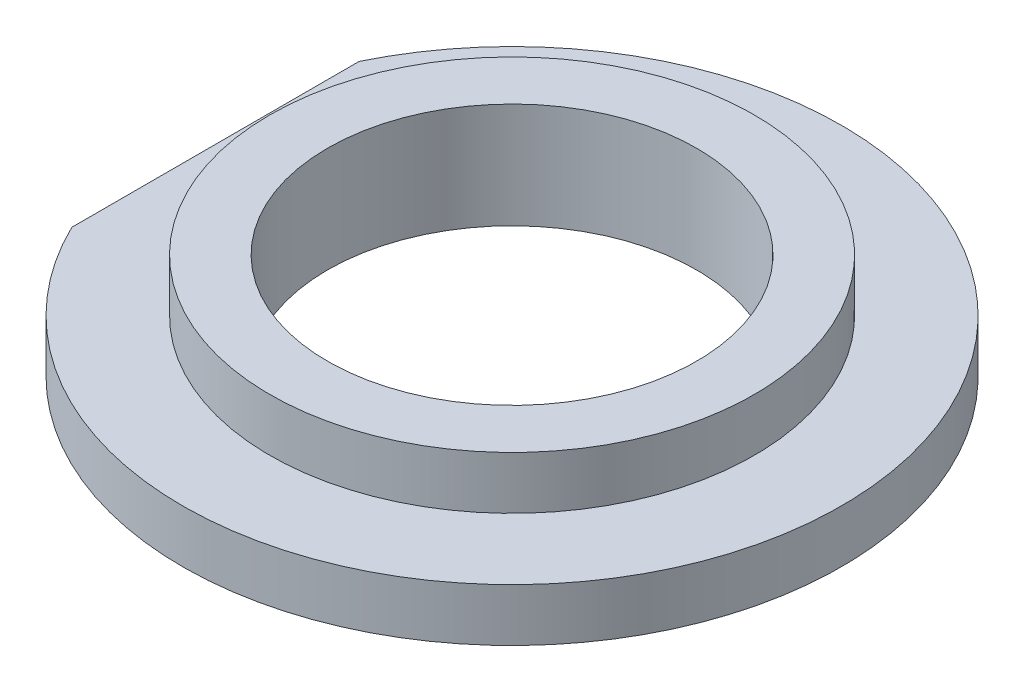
ISO-10303-21;
HEADER;
FILE_DESCRIPTION(('STEP AP214'),'2;1');
FILE_NAME('part.step','',(''),(''),'','','');
FILE_SCHEMA(('AUTOMOTIVE_DESIGN { 1 0 10303 214 1 1 1 1 }'));
ENDSEC;
DATA;
#1=APPLICATION_CONTEXT('core data for automotive mechanical design processes');
#2=APPLICATION_PROTOCOL_DEFINITION('international standard','automotive_design',2000,#1);
#3=PRODUCT_CONTEXT('',#1,'mechanical');
#4=PRODUCT('Part','Part','',(#3));
#5=PRODUCT_RELATED_PRODUCT_CATEGORY('part','',(#4));
#6=PRODUCT_DEFINITION_FORMATION('','',#4);
#7=PRODUCT_DEFINITION_CONTEXT('part definition',#1,'design');
#8=PRODUCT_DEFINITION('design','',#6,#7);
#9=PRODUCT_DEFINITION_SHAPE('','',#8);
#10=(LENGTH_UNIT() NAMED_UNIT(*) SI_UNIT(.MILLI.,.METRE.));
#11=(NAMED_UNIT(*) PLANE_ANGLE_UNIT() SI_UNIT($,.RADIAN.));
#12=(NAMED_UNIT(*) SI_UNIT($,.STERADIAN.) SOLID_ANGLE_UNIT());
#13=UNCERTAINTY_MEASURE_WITH_UNIT(LENGTH_MEASURE(1.E-05),#10,'distance_accuracy_value','');
#14=(GEOMETRIC_REPRESENTATION_CONTEXT(3) GLOBAL_UNCERTAINTY_ASSIGNED_CONTEXT((#13)) GLOBAL_UNIT_ASSIGNED_CONTEXT((#10,
#11,#12)) REPRESENTATION_CONTEXT('',''));
#15=CARTESIAN_POINT('',(0.,0.,0.));
#16=DIRECTION('',(0.,0.,1.));
#17=DIRECTION('',(1.,0.,0.));
#18=AXIS2_PLACEMENT_3D('',#15,#16,#17);
#19=CARTESIAN_POINT('',(0.,0.,0.));
#20=DIRECTION('',(0.,-1.,0.));
#21=DIRECTION('',(1.,0.,0.));
#22=AXIS2_PLACEMENT_3D('',#19,#20,#21);
#23=PLANE('',#22);
#24=DIRECTION('',(0.,0.,-1.));
#25=VECTOR('',#24,1.);
#26=CARTESIAN_POINT('',(-90.,0.,-86.2001776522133));
#27=LINE('',#26,#25);
#28=CARTESIAN_POINT('',(-90.,0.,43.5889894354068));
#29=VERTEX_POINT('',#28);
#30=CARTESIAN_POINT('',(-90.,0.,-43.5889894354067));
#31=VERTEX_POINT('',#30);
#32=EDGE_CURVE('E81',#29,#31,#27,.T.);
#33=ORIENTED_EDGE('',*,*,#32,.T.);
#34=CARTESIAN_POINT('',(0.,0.,0.));
#35=DIRECTION('',(0.,1.,0.));
#36=DIRECTION('',(-1.,0.,0.));
#37=AXIS2_PLACEMENT_3D('',#34,#35,#36);
#38=CIRCLE('',#37,100.);
#39=EDGE_CURVE('E38',#29,#31,#38,.T.);
#40=ORIENTED_EDGE('',*,*,#39,.F.);
#41=EDGE_LOOP('',(#33,#40));
#42=FACE_BOUND('',#41,.T.);
#43=CARTESIAN_POINT('',(0.,0.,0.));
#44=DIRECTION('',(0.,1.,0.));
#45=DIRECTION('',(-1.,0.,0.));
#46=AXIS2_PLACEMENT_3D('',#43,#44,#45);
#47=CIRCLE('',#46,56.);
#48=CARTESIAN_POINT('',(-56.,0.,0.));
#49=VERTEX_POINT('',#48);
#50=EDGE_CURVE('E75',#49,#49,#47,.T.);
#51=ORIENTED_EDGE('',*,*,#50,.T.);
#52=EDGE_LOOP('',(#51));
#53=FACE_BOUND('',#52,.T.);
#54=ADVANCED_FACE('F31',(#42,#53),#23,.T.);
#55=CARTESIAN_POINT('',(0.,32.,0.));
#56=DIRECTION('',(0.,1.,0.));
#57=DIRECTION('',(-1.,0.,0.));
#58=AXIS2_PLACEMENT_3D('',#55,#56,#57);
#59=CYLINDRICAL_SURFACE('',#58,100.);
#60=DIRECTION('',(0.,1.,0.));
#61=VECTOR('',#60,1.);
#62=CARTESIAN_POINT('',(-90.,32.,-43.5889894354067));
#63=LINE('',#62,#61);
#64=CARTESIAN_POINT('',(-90.,16.,-43.5889894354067));
#65=VERTEX_POINT('',#64);
#66=EDGE_CURVE('E49',#65,#31,#63,.F.);
#67=ORIENTED_EDGE('',*,*,#66,.F.);
#68=CARTESIAN_POINT('',(0.,16.,0.));
#69=DIRECTION('',(0.,1.,0.));
#70=DIRECTION('',(-1.,0.,0.));
#71=AXIS2_PLACEMENT_3D('',#68,#69,#70);
#72=CIRCLE('',#71,100.);
#73=CARTESIAN_POINT('',(-90.,16.,43.5889894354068));
#74=VERTEX_POINT('',#73);
#75=EDGE_CURVE('E61',#74,#65,#72,.T.);
#76=ORIENTED_EDGE('',*,*,#75,.F.);
#77=DIRECTION('',(0.,1.,0.));
#78=VECTOR('',#77,1.);
#79=CARTESIAN_POINT('',(-90.,32.,43.5889894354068));
#80=LINE('',#79,#78);
#81=EDGE_CURVE('E44',#29,#74,#80,.T.);
#82=ORIENTED_EDGE('',*,*,#81,.F.);
#83=ORIENTED_EDGE('',*,*,#39,.T.);
#84=EDGE_LOOP('',(#67,#76,#82,#83));
#85=FACE_BOUND('',#84,.T.);
#86=ADVANCED_FACE('F60',(#85),#59,.T.);
#87=CARTESIAN_POINT('',(-100.,16.,0.));
#88=DIRECTION('',(0.,1.,0.));
#89=DIRECTION('',(-1.,0.,0.));
#90=AXIS2_PLACEMENT_3D('',#87,#88,#89);
#91=PLANE('',#90);
#92=DIRECTION('',(0.,0.,-1.));
#93=VECTOR('',#92,1.);
#94=CARTESIAN_POINT('',(-90.,16.,0.));
#95=LINE('',#94,#93);
#96=EDGE_CURVE('E11',#74,#65,#95,.T.);
#97=ORIENTED_EDGE('',*,*,#96,.F.);
#98=ORIENTED_EDGE('',*,*,#75,.T.);
#99=EDGE_LOOP('',(#97,#98));
#100=FACE_BOUND('',#99,.T.);
#101=CARTESIAN_POINT('',(0.,16.,0.));
#102=DIRECTION('',(0.,1.,0.));
#103=DIRECTION('',(-1.,0.,0.));
#104=AXIS2_PLACEMENT_3D('',#101,#102,#103);
#105=CIRCLE('',#104,73.5);
#106=CARTESIAN_POINT('',(-73.5,16.,0.));
#107=VERTEX_POINT('',#106);
#108=EDGE_CURVE('E67',#107,#107,#105,.T.);
#109=ORIENTED_EDGE('',*,*,#108,.F.);
#110=EDGE_LOOP('',(#109));
#111=FACE_BOUND('',#110,.T.);
#112=ADVANCED_FACE('F65',(#100,#111),#91,.T.);
#113=CARTESIAN_POINT('',(0.,32.,0.));
#114=DIRECTION('',(0.,1.,0.));
#115=DIRECTION('',(-1.,0.,0.));
#116=AXIS2_PLACEMENT_3D('',#113,#114,#115);
#117=CYLINDRICAL_SURFACE('',#116,73.5);
#118=ORIENTED_EDGE('',*,*,#108,.T.);
#119=EDGE_LOOP('',(#118));
#120=FACE_BOUND('',#119,.T.);
#121=CARTESIAN_POINT('',(0.,32.,0.));
#122=DIRECTION('',(0.,1.,0.));
#123=DIRECTION('',(-1.,0.,0.));
#124=AXIS2_PLACEMENT_3D('',#121,#122,#123);
#125=CIRCLE('',#124,73.5);
#126=CARTESIAN_POINT('',(-73.5,32.,0.));
#127=VERTEX_POINT('',#126);
#128=EDGE_CURVE('E70',#127,#127,#125,.T.);
#129=ORIENTED_EDGE('',*,*,#128,.F.);
#130=EDGE_LOOP('',(#129));
#131=FACE_BOUND('',#130,.T.);
#132=ADVANCED_FACE('F96',(#120,#131),#117,.T.);
#133=CARTESIAN_POINT('',(-73.5,32.,0.));
#134=DIRECTION('',(0.,1.,0.));
#135=DIRECTION('',(-1.,0.,0.));
#136=AXIS2_PLACEMENT_3D('',#133,#134,#135);
#137=PLANE('',#136);
#138=CARTESIAN_POINT('',(0.,32.,0.));
#139=DIRECTION('',(0.,1.,0.));
#140=DIRECTION('',(-1.,0.,0.));
#141=AXIS2_PLACEMENT_3D('',#138,#139,#140);
#142=CIRCLE('',#141,56.);
#143=CARTESIAN_POINT('',(-56.,32.,0.));
#144=VERTEX_POINT('',#143);
#145=EDGE_CURVE('E63',#144,#144,#142,.T.);
#146=ORIENTED_EDGE('',*,*,#145,.F.);
#147=EDGE_LOOP('',(#146));
#148=FACE_BOUND('',#147,.T.);
#149=ORIENTED_EDGE('',*,*,#128,.T.);
#150=EDGE_LOOP('',(#149));
#151=FACE_BOUND('',#150,.T.);
#152=ADVANCED_FACE('F90',(#148,#151),#137,.T.);
#153=CARTESIAN_POINT('',(0.,0.,0.));
#154=DIRECTION('',(0.,1.,0.));
#155=DIRECTION('',(-1.,0.,0.));
#156=AXIS2_PLACEMENT_3D('',#153,#154,#155);
#157=CYLINDRICAL_SURFACE('',#156,56.);
#158=ORIENTED_EDGE('',*,*,#50,.F.);
#159=EDGE_LOOP('',(#158));
#160=FACE_BOUND('',#159,.T.);
#161=ORIENTED_EDGE('',*,*,#145,.T.);
#162=EDGE_LOOP('',(#161));
#163=FACE_BOUND('',#162,.T.);
#164=ADVANCED_FACE('F87',(#160,#163),#157,.F.);
#165=CARTESIAN_POINT('',(-90.,0.,-86.2001776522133));
#166=DIRECTION('',(1.,0.,0.));
#167=DIRECTION('',(0.,0.,-1.));
#168=AXIS2_PLACEMENT_3D('',#165,#166,#167);
#169=PLANE('',#168);
#170=ORIENTED_EDGE('',*,*,#66,.T.);
#171=ORIENTED_EDGE('',*,*,#32,.F.);
#172=ORIENTED_EDGE('',*,*,#81,.T.);
#173=ORIENTED_EDGE('',*,*,#96,.T.);
#174=EDGE_LOOP('',(#170,#171,#172,#173));
#175=FACE_BOUND('',#174,.T.);
#176=ADVANCED_FACE('F54',(#175),#169,.F.);
#177=CLOSED_SHELL('',(#54,#86,#112,#132,#152,#164,#176));
#178=MANIFOLD_SOLID_BREP('B2',#177);
#179=ADVANCED_BREP_SHAPE_REPRESENTATION('',(#18,#178),#14);
#180=SHAPE_DEFINITION_REPRESENTATION(#9,#179);
ENDSEC;
END-ISO-10303-21;
